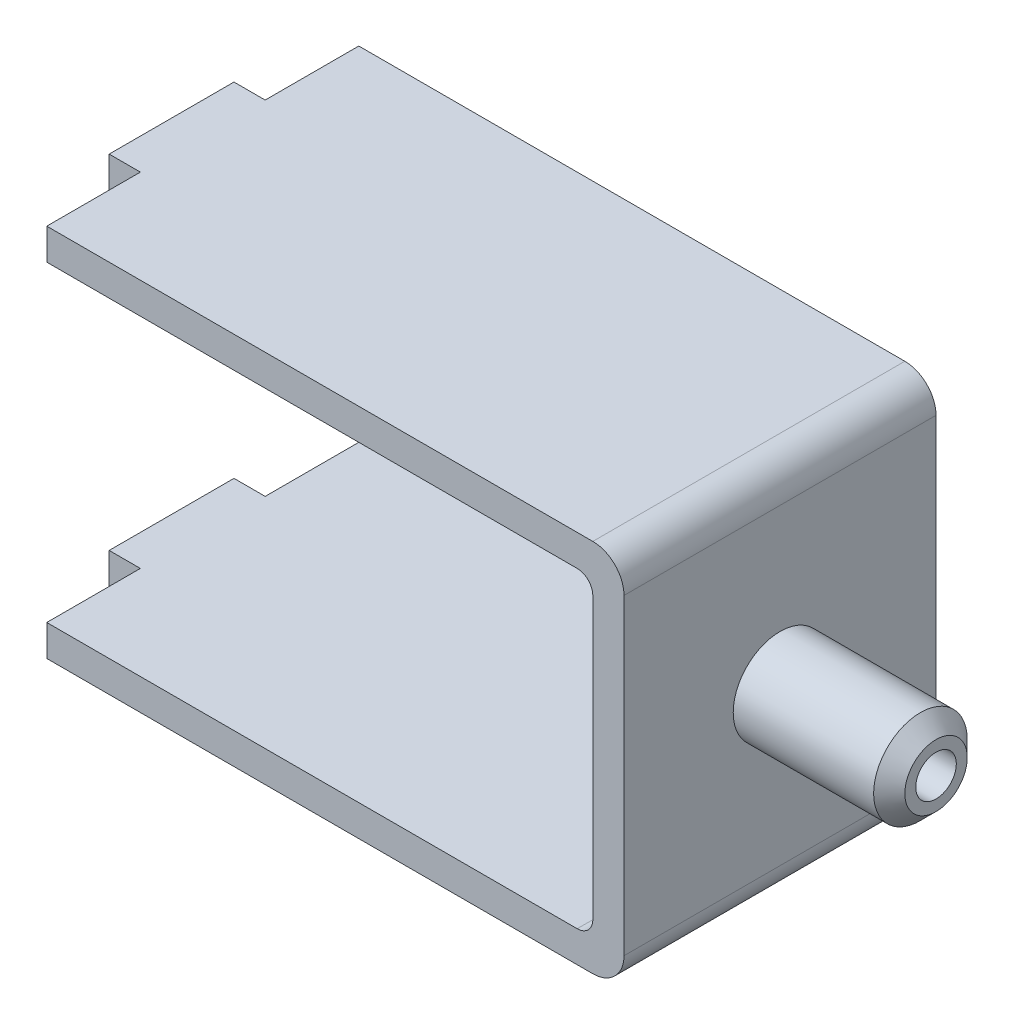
ISO-10303-21;
HEADER;
FILE_DESCRIPTION(('STEP AP214'),'2;1');
FILE_NAME('part.step','',(''),(''),'','','');
FILE_SCHEMA(('AUTOMOTIVE_DESIGN { 1 0 10303 214 1 1 1 1 }'));
ENDSEC;
DATA;
#1=APPLICATION_CONTEXT('core data for automotive mechanical design processes');
#2=APPLICATION_PROTOCOL_DEFINITION('international standard','automotive_design',2000,#1);
#3=PRODUCT_CONTEXT('',#1,'mechanical');
#4=PRODUCT('Part','Part','',(#3));
#5=PRODUCT_RELATED_PRODUCT_CATEGORY('part','',(#4));
#6=PRODUCT_DEFINITION_FORMATION('','',#4);
#7=PRODUCT_DEFINITION_CONTEXT('part definition',#1,'design');
#8=PRODUCT_DEFINITION('design','',#6,#7);
#9=PRODUCT_DEFINITION_SHAPE('','',#8);
#10=(LENGTH_UNIT() NAMED_UNIT(*) SI_UNIT(.MILLI.,.METRE.));
#11=(NAMED_UNIT(*) PLANE_ANGLE_UNIT() SI_UNIT($,.RADIAN.));
#12=(NAMED_UNIT(*) SI_UNIT($,.STERADIAN.) SOLID_ANGLE_UNIT());
#13=UNCERTAINTY_MEASURE_WITH_UNIT(LENGTH_MEASURE(1.E-05),#10,'distance_accuracy_value','');
#14=(GEOMETRIC_REPRESENTATION_CONTEXT(3) GLOBAL_UNCERTAINTY_ASSIGNED_CONTEXT((#13)) GLOBAL_UNIT_ASSIGNED_CONTEXT((#10,
#11,#12)) REPRESENTATION_CONTEXT('',''));
#15=CARTESIAN_POINT('',(0.,0.,0.));
#16=DIRECTION('',(0.,0.,1.));
#17=DIRECTION('',(1.,0.,0.));
#18=AXIS2_PLACEMENT_3D('',#15,#16,#17);
#19=CARTESIAN_POINT('',(0.,5.99999999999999,5.));
#20=DIRECTION('',(-1.,0.,0.));
#21=DIRECTION('',(0.,0.,1.));
#22=AXIS2_PLACEMENT_3D('',#19,#20,#21);
#23=PLANE('',#22);
#24=DIRECTION('',(0.,1.,0.));
#25=VECTOR('',#24,1.);
#26=CARTESIAN_POINT('',(0.,5.99999999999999,5.));
#27=LINE('',#26,#25);
#28=CARTESIAN_POINT('',(0.,-5.,5.));
#29=VERTEX_POINT('',#28);
#30=CARTESIAN_POINT('',(0.,4.99999999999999,5.));
#31=VERTEX_POINT('',#30);
#32=EDGE_CURVE('E202',#29,#31,#27,.T.);
#33=ORIENTED_EDGE('',*,*,#32,.F.);
#34=DIRECTION('',(0.,0.,-1.));
#35=VECTOR('',#34,1.);
#36=CARTESIAN_POINT('',(0.,-5.,5.));
#37=LINE('',#36,#35);
#38=CARTESIAN_POINT('',(0.,-5.,-5.));
#39=VERTEX_POINT('',#38);
#40=EDGE_CURVE('E212',#29,#39,#37,.T.);
#41=ORIENTED_EDGE('',*,*,#40,.T.);
#42=DIRECTION('',(0.,1.,0.));
#43=VECTOR('',#42,1.);
#44=CARTESIAN_POINT('',(0.,5.99999999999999,-5.));
#45=LINE('',#44,#43);
#46=CARTESIAN_POINT('',(0.,4.99999999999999,-5.));
#47=VERTEX_POINT('',#46);
#48=EDGE_CURVE('E357',#39,#47,#45,.T.);
#49=ORIENTED_EDGE('',*,*,#48,.T.);
#50=DIRECTION('',(0.,0.,-1.));
#51=VECTOR('',#50,1.);
#52=CARTESIAN_POINT('',(0.,4.99999999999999,5.));
#53=LINE('',#52,#51);
#54=EDGE_CURVE('E210',#47,#31,#53,.F.);
#55=ORIENTED_EDGE('',*,*,#54,.T.);
#56=EDGE_LOOP('',(#33,#41,#49,#55));
#57=FACE_BOUND('',#56,.T.);
#58=CARTESIAN_POINT('',(0.,0.,0.));
#59=DIRECTION('',(-1.,0.,0.));
#60=DIRECTION('',(0.,0.,1.));
#61=AXIS2_PLACEMENT_3D('',#58,#59,#60);
#62=CIRCLE('',#61,1.5);
#63=CARTESIAN_POINT('',(0.,0.,1.5));
#64=VERTEX_POINT('',#63);
#65=EDGE_CURVE('E255',#64,#64,#62,.F.);
#66=ORIENTED_EDGE('',*,*,#65,.F.);
#67=EDGE_LOOP('',(#66));
#68=FACE_BOUND('',#67,.T.);
#69=ADVANCED_FACE('F33',(#57,#68),#23,.F.);
#70=CARTESIAN_POINT('',(-19.5,5.99999999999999,5.));
#71=DIRECTION('',(1.,0.,0.));
#72=DIRECTION('',(0.,0.,-1.));
#73=AXIS2_PLACEMENT_3D('',#70,#71,#72);
#74=PLANE('',#73);
#75=DIRECTION('',(0.,0.,-1.));
#76=VECTOR('',#75,1.);
#77=CARTESIAN_POINT('',(-19.5,5.99999999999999,5.));
#78=LINE('',#77,#76);
#79=CARTESIAN_POINT('',(-19.5,5.99999999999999,2.));
#80=VERTEX_POINT('',#79);
#81=CARTESIAN_POINT('',(-19.5,5.99999999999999,-2.));
#82=VERTEX_POINT('',#81);
#83=EDGE_CURVE('E190',#80,#82,#78,.T.);
#84=ORIENTED_EDGE('',*,*,#83,.T.);
#85=DIRECTION('',(0.,1.,0.));
#86=VECTOR('',#85,1.);
#87=CARTESIAN_POINT('',(-19.5,-6.,-2.));
#88=LINE('',#87,#86);
#89=CARTESIAN_POINT('',(-19.5,4.99999999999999,-2.));
#90=VERTEX_POINT('',#89);
#91=EDGE_CURVE('E171',#90,#82,#88,.T.);
#92=ORIENTED_EDGE('',*,*,#91,.F.);
#93=DIRECTION('',(0.,0.,-1.));
#94=VECTOR('',#93,1.);
#95=CARTESIAN_POINT('',(-19.5,4.99999999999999,5.));
#96=LINE('',#95,#94);
#97=CARTESIAN_POINT('',(-19.5,4.99999999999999,2.));
#98=VERTEX_POINT('',#97);
#99=EDGE_CURVE('E208',#98,#90,#96,.T.);
#100=ORIENTED_EDGE('',*,*,#99,.F.);
#101=DIRECTION('',(0.,1.,0.));
#102=VECTOR('',#101,1.);
#103=CARTESIAN_POINT('',(-19.5,-6.,2.));
#104=LINE('',#103,#102);
#105=EDGE_CURVE('E194',#98,#80,#104,.T.);
#106=ORIENTED_EDGE('',*,*,#105,.T.);
#107=EDGE_LOOP('',(#84,#92,#100,#106));
#108=FACE_BOUND('',#107,.T.);
#109=ADVANCED_FACE('F35',(#108),#74,.F.);
#110=CARTESIAN_POINT('',(-18.5,4.99999999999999,5.));
#111=DIRECTION('',(0.,1.,0.));
#112=DIRECTION('',(0.,0.,1.));
#113=AXIS2_PLACEMENT_3D('',#110,#111,#112);
#114=PLANE('',#113);
#115=DIRECTION('',(1.,0.,0.));
#116=VECTOR('',#115,1.);
#117=CARTESIAN_POINT('',(-18.5,4.99999999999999,-2.));
#118=LINE('',#117,#116);
#119=CARTESIAN_POINT('',(-18.5,4.99999999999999,-2.));
#120=VERTEX_POINT('',#119);
#121=EDGE_CURVE('E177',#90,#120,#118,.T.);
#122=ORIENTED_EDGE('',*,*,#121,.T.);
#123=DIRECTION('',(0.,0.,-1.));
#124=VECTOR('',#123,1.);
#125=CARTESIAN_POINT('',(-18.5,4.99999999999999,5.));
#126=LINE('',#125,#124);
#127=CARTESIAN_POINT('',(-18.5,4.99999999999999,-5.));
#128=VERTEX_POINT('',#127);
#129=EDGE_CURVE('E307',#120,#128,#126,.T.);
#130=ORIENTED_EDGE('',*,*,#129,.T.);
#131=DIRECTION('',(1.,0.,0.));
#132=VECTOR('',#131,1.);
#133=CARTESIAN_POINT('',(-18.5,4.99999999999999,-5.));
#134=LINE('',#133,#132);
#135=CARTESIAN_POINT('',(-1.5,4.99999999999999,-5.));
#136=VERTEX_POINT('',#135);
#137=EDGE_CURVE('E347',#128,#136,#134,.T.);
#138=ORIENTED_EDGE('',*,*,#137,.T.);
#139=DIRECTION('',(0.,0.,-1.));
#140=VECTOR('',#139,1.);
#141=CARTESIAN_POINT('',(-1.5,4.99999999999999,5.));
#142=LINE('',#141,#140);
#143=CARTESIAN_POINT('',(-1.5,4.99999999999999,5.));
#144=VERTEX_POINT('',#143);
#145=EDGE_CURVE('E235',#136,#144,#142,.F.);
#146=ORIENTED_EDGE('',*,*,#145,.T.);
#147=DIRECTION('',(1.,0.,0.));
#148=VECTOR('',#147,1.);
#149=CARTESIAN_POINT('',(-18.5,4.99999999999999,5.));
#150=LINE('',#149,#148);
#151=CARTESIAN_POINT('',(-18.5,4.99999999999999,5.));
#152=VERTEX_POINT('',#151);
#153=EDGE_CURVE('E362',#152,#144,#150,.T.);
#154=ORIENTED_EDGE('',*,*,#153,.F.);
#155=DIRECTION('',(0.,0.,-1.));
#156=VECTOR('',#155,1.);
#157=CARTESIAN_POINT('',(-18.5,4.99999999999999,5.));
#158=LINE('',#157,#156);
#159=CARTESIAN_POINT('',(-18.5,4.99999999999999,2.));
#160=VERTEX_POINT('',#159);
#161=EDGE_CURVE('E339',#152,#160,#158,.T.);
#162=ORIENTED_EDGE('',*,*,#161,.T.);
#163=DIRECTION('',(-1.,0.,0.));
#164=VECTOR('',#163,1.);
#165=CARTESIAN_POINT('',(-18.5,4.99999999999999,2.));
#166=LINE('',#165,#164);
#167=EDGE_CURVE('E345',#160,#98,#166,.T.);
#168=ORIENTED_EDGE('',*,*,#167,.T.);
#169=ORIENTED_EDGE('',*,*,#99,.T.);
#170=EDGE_LOOP('',(#122,#130,#138,#146,#154,#162,#168,#169));
#171=FACE_BOUND('',#170,.T.);
#172=ADVANCED_FACE('F281',(#171),#114,.F.);
#173=CARTESIAN_POINT('',(-1.,4.99999999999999,5.));
#174=DIRECTION('',(1.,0.,0.));
#175=DIRECTION('',(0.,1.,0.));
#176=AXIS2_PLACEMENT_3D('',#173,#174,#175);
#177=PLANE('',#176);
#178=DIRECTION('',(0.,-1.,0.));
#179=VECTOR('',#178,1.);
#180=CARTESIAN_POINT('',(-1.,4.99999999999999,5.));
#181=LINE('',#180,#179);
#182=CARTESIAN_POINT('',(-1.,4.49999999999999,5.));
#183=VERTEX_POINT('',#182);
#184=CARTESIAN_POINT('',(-0.999999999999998,-4.5,5.));
#185=VERTEX_POINT('',#184);
#186=EDGE_CURVE('E364',#183,#185,#181,.T.);
#187=ORIENTED_EDGE('',*,*,#186,.F.);
#188=DIRECTION('',(0.,0.,-1.));
#189=VECTOR('',#188,1.);
#190=CARTESIAN_POINT('',(-1.,4.49999999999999,-5.));
#191=LINE('',#190,#189);
#192=CARTESIAN_POINT('',(-1.,4.49999999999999,-5.));
#193=VERTEX_POINT('',#192);
#194=EDGE_CURVE('E232',#183,#193,#191,.T.);
#195=ORIENTED_EDGE('',*,*,#194,.T.);
#196=DIRECTION('',(0.,-1.,0.));
#197=VECTOR('',#196,1.);
#198=CARTESIAN_POINT('',(-1.,4.99999999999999,-5.));
#199=LINE('',#198,#197);
#200=CARTESIAN_POINT('',(-0.999999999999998,-4.5,-5.));
#201=VERTEX_POINT('',#200);
#202=EDGE_CURVE('E349',#193,#201,#199,.T.);
#203=ORIENTED_EDGE('',*,*,#202,.T.);
#204=DIRECTION('',(0.,0.,-1.));
#205=VECTOR('',#204,1.);
#206=CARTESIAN_POINT('',(-0.999999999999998,-4.5,5.));
#207=LINE('',#206,#205);
#208=EDGE_CURVE('E230',#201,#185,#207,.F.);
#209=ORIENTED_EDGE('',*,*,#208,.T.);
#210=EDGE_LOOP('',(#187,#195,#203,#209));
#211=FACE_BOUND('',#210,.T.);
#212=ADVANCED_FACE('F298',(#211),#177,.F.);
#213=CARTESIAN_POINT('',(-18.5,-5.,5.));
#214=DIRECTION('',(0.,-1.,0.));
#215=DIRECTION('',(0.,0.,-1.));
#216=AXIS2_PLACEMENT_3D('',#213,#214,#215);
#217=PLANE('',#216);
#218=DIRECTION('',(-1.,0.,0.));
#219=VECTOR('',#218,1.);
#220=CARTESIAN_POINT('',(-18.5,-5.,-5.));
#221=LINE('',#220,#219);
#222=CARTESIAN_POINT('',(-1.5,-5.,-5.));
#223=VERTEX_POINT('',#222);
#224=CARTESIAN_POINT('',(-18.5,-5.,-5.));
#225=VERTEX_POINT('',#224);
#226=EDGE_CURVE('E352',#223,#225,#221,.T.);
#227=ORIENTED_EDGE('',*,*,#226,.T.);
#228=DIRECTION('',(0.,0.,1.));
#229=VECTOR('',#228,1.);
#230=CARTESIAN_POINT('',(-18.5,-5.,5.));
#231=LINE('',#230,#229);
#232=CARTESIAN_POINT('',(-18.5,-5.,-2.));
#233=VERTEX_POINT('',#232);
#234=EDGE_CURVE('E56',#225,#233,#231,.T.);
#235=ORIENTED_EDGE('',*,*,#234,.T.);
#236=DIRECTION('',(-1.,0.,0.));
#237=VECTOR('',#236,1.);
#238=CARTESIAN_POINT('',(-18.5,-5.,-2.));
#239=LINE('',#238,#237);
#240=CARTESIAN_POINT('',(-19.5,-5.,-2.));
#241=VERTEX_POINT('',#240);
#242=EDGE_CURVE('E311',#233,#241,#239,.T.);
#243=ORIENTED_EDGE('',*,*,#242,.T.);
#244=DIRECTION('',(0.,0.,-1.));
#245=VECTOR('',#244,1.);
#246=CARTESIAN_POINT('',(-19.5,-5.,5.));
#247=LINE('',#246,#245);
#248=CARTESIAN_POINT('',(-19.5,-5.,2.));
#249=VERTEX_POINT('',#248);
#250=EDGE_CURVE('E199',#249,#241,#247,.T.);
#251=ORIENTED_EDGE('',*,*,#250,.F.);
#252=DIRECTION('',(1.,0.,0.));
#253=VECTOR('',#252,1.);
#254=CARTESIAN_POINT('',(-18.5,-5.,2.));
#255=LINE('',#254,#253);
#256=CARTESIAN_POINT('',(-18.5,-5.,2.));
#257=VERTEX_POINT('',#256);
#258=EDGE_CURVE('E342',#249,#257,#255,.T.);
#259=ORIENTED_EDGE('',*,*,#258,.T.);
#260=DIRECTION('',(0.,0.,1.));
#261=VECTOR('',#260,1.);
#262=CARTESIAN_POINT('',(-18.5,-5.,5.));
#263=LINE('',#262,#261);
#264=CARTESIAN_POINT('',(-18.5,-5.,5.));
#265=VERTEX_POINT('',#264);
#266=EDGE_CURVE('E331',#257,#265,#263,.T.);
#267=ORIENTED_EDGE('',*,*,#266,.T.);
#268=DIRECTION('',(-1.,0.,0.));
#269=VECTOR('',#268,1.);
#270=CARTESIAN_POINT('',(-18.5,-5.,5.));
#271=LINE('',#270,#269);
#272=CARTESIAN_POINT('',(-1.5,-5.,5.));
#273=VERTEX_POINT('',#272);
#274=EDGE_CURVE('E367',#273,#265,#271,.T.);
#275=ORIENTED_EDGE('',*,*,#274,.F.);
#276=DIRECTION('',(0.,0.,-1.));
#277=VECTOR('',#276,1.);
#278=CARTESIAN_POINT('',(-1.5,-5.,-5.));
#279=LINE('',#278,#277);
#280=EDGE_CURVE('E238',#273,#223,#279,.T.);
#281=ORIENTED_EDGE('',*,*,#280,.T.);
#282=EDGE_LOOP('',(#227,#235,#243,#251,#259,#267,#275,#281));
#283=FACE_BOUND('',#282,.T.);
#284=ADVANCED_FACE('F294',(#283),#217,.F.);
#285=CARTESIAN_POINT('',(-19.5,-5.,5.));
#286=DIRECTION('',(1.,0.,0.));
#287=DIRECTION('',(0.,0.,-1.));
#288=AXIS2_PLACEMENT_3D('',#285,#286,#287);
#289=PLANE('',#288);
#290=ORIENTED_EDGE('',*,*,#250,.T.);
#291=CARTESIAN_POINT('',(-19.5,-6.,-2.));
#292=VERTEX_POINT('',#291);
#293=EDGE_CURVE('E182',#292,#241,#88,.T.);
#294=ORIENTED_EDGE('',*,*,#293,.F.);
#295=DIRECTION('',(0.,0.,-1.));
#296=VECTOR('',#295,1.);
#297=CARTESIAN_POINT('',(-19.5,-6.,5.));
#298=LINE('',#297,#296);
#299=CARTESIAN_POINT('',(-19.5,-6.,2.));
#300=VERTEX_POINT('',#299);
#301=EDGE_CURVE('E195',#300,#292,#298,.T.);
#302=ORIENTED_EDGE('',*,*,#301,.F.);
#303=EDGE_CURVE('E328',#300,#249,#104,.T.);
#304=ORIENTED_EDGE('',*,*,#303,.T.);
#305=EDGE_LOOP('',(#290,#294,#302,#304));
#306=FACE_BOUND('',#305,.T.);
#307=ADVANCED_FACE('F290',(#306),#289,.F.);
#308=CARTESIAN_POINT('',(-19.5,-6.,5.));
#309=DIRECTION('',(0.,1.,0.));
#310=DIRECTION('',(-1.,0.,0.));
#311=AXIS2_PLACEMENT_3D('',#308,#309,#310);
#312=PLANE('',#311);
#313=DIRECTION('',(1.,0.,0.));
#314=VECTOR('',#313,1.);
#315=CARTESIAN_POINT('',(-19.5,-6.,-2.));
#316=LINE('',#315,#314);
#317=CARTESIAN_POINT('',(-18.5,-6.,-2.));
#318=VERTEX_POINT('',#317);
#319=EDGE_CURVE('E631',#292,#318,#316,.T.);
#320=ORIENTED_EDGE('',*,*,#319,.T.);
#321=DIRECTION('',(0.,0.,-1.));
#322=VECTOR('',#321,1.);
#323=CARTESIAN_POINT('',(-18.5,-6.,-2.));
#324=LINE('',#323,#322);
#325=CARTESIAN_POINT('',(-18.5,-6.,-5.));
#326=VERTEX_POINT('',#325);
#327=EDGE_CURVE('E183',#318,#326,#324,.T.);
#328=ORIENTED_EDGE('',*,*,#327,.T.);
#329=DIRECTION('',(1.,0.,0.));
#330=VECTOR('',#329,1.);
#331=CARTESIAN_POINT('',(-19.5,-6.,-5.));
#332=LINE('',#331,#330);
#333=CARTESIAN_POINT('',(-1.,-6.,-5.));
#334=VERTEX_POINT('',#333);
#335=EDGE_CURVE('E355',#326,#334,#332,.T.);
#336=ORIENTED_EDGE('',*,*,#335,.T.);
#337=DIRECTION('',(0.,0.,-1.));
#338=VECTOR('',#337,1.);
#339=CARTESIAN_POINT('',(-1.,-6.,5.));
#340=LINE('',#339,#338);
#341=CARTESIAN_POINT('',(-1.,-6.,5.));
#342=VERTEX_POINT('',#341);
#343=EDGE_CURVE('E220',#334,#342,#340,.F.);
#344=ORIENTED_EDGE('',*,*,#343,.T.);
#345=DIRECTION('',(1.,0.,0.));
#346=VECTOR('',#345,1.);
#347=CARTESIAN_POINT('',(-19.5,-6.,5.));
#348=LINE('',#347,#346);
#349=CARTESIAN_POINT('',(-18.5,-6.,5.));
#350=VERTEX_POINT('',#349);
#351=EDGE_CURVE('E370',#350,#342,#348,.T.);
#352=ORIENTED_EDGE('',*,*,#351,.F.);
#353=DIRECTION('',(0.,0.,-1.));
#354=VECTOR('',#353,1.);
#355=CARTESIAN_POINT('',(-18.5,-6.,2.));
#356=LINE('',#355,#354);
#357=CARTESIAN_POINT('',(-18.5,-6.,2.));
#358=VERTEX_POINT('',#357);
#359=EDGE_CURVE('E321',#350,#358,#356,.T.);
#360=ORIENTED_EDGE('',*,*,#359,.T.);
#361=DIRECTION('',(-1.,0.,0.));
#362=VECTOR('',#361,1.);
#363=CARTESIAN_POINT('',(-19.5,-6.,2.));
#364=LINE('',#363,#362);
#365=EDGE_CURVE('E324',#358,#300,#364,.T.);
#366=ORIENTED_EDGE('',*,*,#365,.T.);
#367=ORIENTED_EDGE('',*,*,#301,.T.);
#368=EDGE_LOOP('',(#320,#328,#336,#344,#352,#360,#366,#367));
#369=FACE_BOUND('',#368,.T.);
#370=ADVANCED_FACE('F287',(#369),#312,.F.);
#371=CARTESIAN_POINT('',(-19.5,5.99999999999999,5.));
#372=DIRECTION('',(0.,-1.,0.));
#373=DIRECTION('',(0.,0.,-1.));
#374=AXIS2_PLACEMENT_3D('',#371,#372,#373);
#375=PLANE('',#374);
#376=DIRECTION('',(-1.,0.,0.));
#377=VECTOR('',#376,1.);
#378=CARTESIAN_POINT('',(-19.5,5.99999999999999,-5.));
#379=LINE('',#378,#377);
#380=CARTESIAN_POINT('',(-1.,5.99999999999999,-5.));
#381=VERTEX_POINT('',#380);
#382=CARTESIAN_POINT('',(-18.5,5.99999999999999,-5.));
#383=VERTEX_POINT('',#382);
#384=EDGE_CURVE('E360',#381,#383,#379,.T.);
#385=ORIENTED_EDGE('',*,*,#384,.T.);
#386=DIRECTION('',(0.,0.,-1.));
#387=VECTOR('',#386,1.);
#388=CARTESIAN_POINT('',(-18.5,5.99999999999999,-2.));
#389=LINE('',#388,#387);
#390=CARTESIAN_POINT('',(-18.5,5.99999999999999,-2.));
#391=VERTEX_POINT('',#390);
#392=EDGE_CURVE('E48',#391,#383,#389,.T.);
#393=ORIENTED_EDGE('',*,*,#392,.F.);
#394=DIRECTION('',(1.,0.,0.));
#395=VECTOR('',#394,1.);
#396=CARTESIAN_POINT('',(-19.5,5.99999999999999,-2.));
#397=LINE('',#396,#395);
#398=EDGE_CURVE('E175',#82,#391,#397,.T.);
#399=ORIENTED_EDGE('',*,*,#398,.F.);
#400=ORIENTED_EDGE('',*,*,#83,.F.);
#401=DIRECTION('',(-1.,0.,0.));
#402=VECTOR('',#401,1.);
#403=CARTESIAN_POINT('',(-19.5,5.99999999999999,2.));
#404=LINE('',#403,#402);
#405=CARTESIAN_POINT('',(-18.5,5.99999999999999,2.));
#406=VERTEX_POINT('',#405);
#407=EDGE_CURVE('E314',#406,#80,#404,.T.);
#408=ORIENTED_EDGE('',*,*,#407,.F.);
#409=DIRECTION('',(0.,0.,-1.));
#410=VECTOR('',#409,1.);
#411=CARTESIAN_POINT('',(-18.5,5.99999999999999,2.));
#412=LINE('',#411,#410);
#413=CARTESIAN_POINT('',(-18.5,5.99999999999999,5.));
#414=VERTEX_POINT('',#413);
#415=EDGE_CURVE('E310',#414,#406,#412,.T.);
#416=ORIENTED_EDGE('',*,*,#415,.F.);
#417=DIRECTION('',(-1.,0.,0.));
#418=VECTOR('',#417,1.);
#419=CARTESIAN_POINT('',(-19.5,5.99999999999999,5.));
#420=LINE('',#419,#418);
#421=CARTESIAN_POINT('',(-1.,5.99999999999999,5.));
#422=VERTEX_POINT('',#421);
#423=EDGE_CURVE('E196',#422,#414,#420,.T.);
#424=ORIENTED_EDGE('',*,*,#423,.F.);
#425=DIRECTION('',(0.,0.,-1.));
#426=VECTOR('',#425,1.);
#427=CARTESIAN_POINT('',(-1.,5.99999999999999,5.));
#428=LINE('',#427,#426);
#429=EDGE_CURVE('E227',#422,#381,#428,.T.);
#430=ORIENTED_EDGE('',*,*,#429,.T.);
#431=EDGE_LOOP('',(#385,#393,#399,#400,#408,#416,#424,#430));
#432=FACE_BOUND('',#431,.T.);
#433=ADVANCED_FACE('F188',(#432),#375,.F.);
#434=CARTESIAN_POINT('',(-19.5,4.99999999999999,5.));
#435=DIRECTION('',(0.,0.,-1.));
#436=DIRECTION('',(-1.,0.,0.));
#437=AXIS2_PLACEMENT_3D('',#434,#435,#436);
#438=PLANE('',#437);
#439=ORIENTED_EDGE('',*,*,#423,.T.);
#440=DIRECTION('',(0.,-1.,0.));
#441=VECTOR('',#440,1.);
#442=CARTESIAN_POINT('',(-18.5,4.99999999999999,5.));
#443=LINE('',#442,#441);
#444=EDGE_CURVE('E250',#414,#152,#443,.T.);
#445=ORIENTED_EDGE('',*,*,#444,.T.);
#446=ORIENTED_EDGE('',*,*,#153,.T.);
#447=CARTESIAN_POINT('',(-1.5,4.49999999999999,5.));
#448=DIRECTION('',(0.,0.,-1.));
#449=DIRECTION('',(-1.,0.,0.));
#450=AXIS2_PLACEMENT_3D('',#447,#448,#449);
#451=CIRCLE('',#450,0.5);
#452=EDGE_CURVE('E244',#144,#183,#451,.T.);
#453=ORIENTED_EDGE('',*,*,#452,.T.);
#454=ORIENTED_EDGE('',*,*,#186,.T.);
#455=CARTESIAN_POINT('',(-1.5,-4.5,5.));
#456=DIRECTION('',(0.,0.,-1.));
#457=DIRECTION('',(-1.,0.,0.));
#458=AXIS2_PLACEMENT_3D('',#455,#456,#457);
#459=CIRCLE('',#458,0.5);
#460=EDGE_CURVE('E248',#185,#273,#459,.T.);
#461=ORIENTED_EDGE('',*,*,#460,.T.);
#462=ORIENTED_EDGE('',*,*,#274,.T.);
#463=DIRECTION('',(0.,1.,0.));
#464=VECTOR('',#463,1.);
#465=CARTESIAN_POINT('',(-18.5,-6.,5.));
#466=LINE('',#465,#464);
#467=EDGE_CURVE('E327',#350,#265,#466,.T.);
#468=ORIENTED_EDGE('',*,*,#467,.F.);
#469=ORIENTED_EDGE('',*,*,#351,.T.);
#470=CARTESIAN_POINT('',(-1.,-5.,5.));
#471=DIRECTION('',(0.,0.,-1.));
#472=DIRECTION('',(-1.,0.,0.));
#473=AXIS2_PLACEMENT_3D('',#470,#471,#472);
#474=CIRCLE('',#473,1.);
#475=EDGE_CURVE('E225',#342,#29,#474,.F.);
#476=ORIENTED_EDGE('',*,*,#475,.T.);
#477=ORIENTED_EDGE('',*,*,#32,.T.);
#478=CARTESIAN_POINT('',(-1.,4.99999999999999,5.));
#479=DIRECTION('',(0.,0.,-1.));
#480=DIRECTION('',(-1.,0.,0.));
#481=AXIS2_PLACEMENT_3D('',#478,#479,#480);
#482=CIRCLE('',#481,1.);
#483=EDGE_CURVE('E223',#31,#422,#482,.F.);
#484=ORIENTED_EDGE('',*,*,#483,.T.);
#485=EDGE_LOOP('',(#439,#445,#446,#453,#454,#461,#462,#468,#469,#476,#477,#484));
#486=FACE_BOUND('',#485,.T.);
#487=ADVANCED_FACE('F374',(#486),#438,.F.);
#488=CARTESIAN_POINT('',(-19.5,4.99999999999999,-5.));
#489=DIRECTION('',(0.,0.,-1.));
#490=DIRECTION('',(-1.,0.,0.));
#491=AXIS2_PLACEMENT_3D('',#488,#489,#490);
#492=PLANE('',#491);
#493=DIRECTION('',(0.,-1.,0.));
#494=VECTOR('',#493,1.);
#495=CARTESIAN_POINT('',(-18.5,4.99999999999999,-5.));
#496=LINE('',#495,#494);
#497=EDGE_CURVE('E253',#383,#128,#496,.T.);
#498=ORIENTED_EDGE('',*,*,#497,.F.);
#499=ORIENTED_EDGE('',*,*,#384,.F.);
#500=CARTESIAN_POINT('',(-1.,4.99999999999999,-5.));
#501=DIRECTION('',(0.,0.,-1.));
#502=DIRECTION('',(-1.,0.,0.));
#503=AXIS2_PLACEMENT_3D('',#500,#501,#502);
#504=CIRCLE('',#503,1.);
#505=EDGE_CURVE('E215',#381,#47,#504,.T.);
#506=ORIENTED_EDGE('',*,*,#505,.T.);
#507=ORIENTED_EDGE('',*,*,#48,.F.);
#508=CARTESIAN_POINT('',(-1.,-5.,-5.));
#509=DIRECTION('',(0.,0.,-1.));
#510=DIRECTION('',(-1.,0.,0.));
#511=AXIS2_PLACEMENT_3D('',#508,#509,#510);
#512=CIRCLE('',#511,1.);
#513=EDGE_CURVE('E217',#39,#334,#512,.T.);
#514=ORIENTED_EDGE('',*,*,#513,.T.);
#515=ORIENTED_EDGE('',*,*,#335,.F.);
#516=DIRECTION('',(0.,1.,0.));
#517=VECTOR('',#516,1.);
#518=CARTESIAN_POINT('',(-18.5,-6.,-5.));
#519=LINE('',#518,#517);
#520=EDGE_CURVE('E391',#326,#225,#519,.T.);
#521=ORIENTED_EDGE('',*,*,#520,.T.);
#522=ORIENTED_EDGE('',*,*,#226,.F.);
#523=CARTESIAN_POINT('',(-1.5,-4.5,-5.));
#524=DIRECTION('',(0.,0.,-1.));
#525=DIRECTION('',(-1.,0.,0.));
#526=AXIS2_PLACEMENT_3D('',#523,#524,#525);
#527=CIRCLE('',#526,0.5);
#528=EDGE_CURVE('E246',#223,#201,#527,.F.);
#529=ORIENTED_EDGE('',*,*,#528,.T.);
#530=ORIENTED_EDGE('',*,*,#202,.F.);
#531=CARTESIAN_POINT('',(-1.5,4.49999999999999,-5.));
#532=DIRECTION('',(0.,0.,-1.));
#533=DIRECTION('',(-1.,0.,0.));
#534=AXIS2_PLACEMENT_3D('',#531,#532,#533);
#535=CIRCLE('',#534,0.5);
#536=EDGE_CURVE('E241',#193,#136,#535,.F.);
#537=ORIENTED_EDGE('',*,*,#536,.T.);
#538=ORIENTED_EDGE('',*,*,#137,.F.);
#539=EDGE_LOOP('',(#498,#499,#506,#507,#514,#515,#521,#522,#529,#530,#537,#538));
#540=FACE_BOUND('',#539,.T.);
#541=ADVANCED_FACE('F385',(#540),#492,.T.);
#542=CARTESIAN_POINT('',(-1.,-5.,5.));
#543=DIRECTION('',(0.,0.,-1.));
#544=DIRECTION('',(-1.,0.,0.));
#545=AXIS2_PLACEMENT_3D('',#542,#543,#544);
#546=CYLINDRICAL_SURFACE('',#545,1.);
#547=ORIENTED_EDGE('',*,*,#475,.F.);
#548=ORIENTED_EDGE('',*,*,#343,.F.);
#549=ORIENTED_EDGE('',*,*,#513,.F.);
#550=ORIENTED_EDGE('',*,*,#40,.F.);
#551=EDGE_LOOP('',(#547,#548,#549,#550));
#552=FACE_BOUND('',#551,.T.);
#553=ADVANCED_FACE('F438',(#552),#546,.T.);
#554=CARTESIAN_POINT('',(-1.,4.99999999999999,5.));
#555=DIRECTION('',(0.,0.,-1.));
#556=DIRECTION('',(-1.,0.,0.));
#557=AXIS2_PLACEMENT_3D('',#554,#555,#556);
#558=CYLINDRICAL_SURFACE('',#557,1.);
#559=ORIENTED_EDGE('',*,*,#483,.F.);
#560=ORIENTED_EDGE('',*,*,#54,.F.);
#561=ORIENTED_EDGE('',*,*,#505,.F.);
#562=ORIENTED_EDGE('',*,*,#429,.F.);
#563=EDGE_LOOP('',(#559,#560,#561,#562));
#564=FACE_BOUND('',#563,.T.);
#565=ADVANCED_FACE('F381',(#564),#558,.T.);
#566=CARTESIAN_POINT('',(-1.5,4.49999999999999,5.));
#567=DIRECTION('',(0.,0.,1.));
#568=DIRECTION('',(1.,0.,0.));
#569=AXIS2_PLACEMENT_3D('',#566,#567,#568);
#570=CYLINDRICAL_SURFACE('',#569,0.5);
#571=ORIENTED_EDGE('',*,*,#452,.F.);
#572=ORIENTED_EDGE('',*,*,#145,.F.);
#573=ORIENTED_EDGE('',*,*,#536,.F.);
#574=ORIENTED_EDGE('',*,*,#194,.F.);
#575=EDGE_LOOP('',(#571,#572,#573,#574));
#576=FACE_BOUND('',#575,.T.);
#577=ADVANCED_FACE('F410',(#576),#570,.F.);
#578=CARTESIAN_POINT('',(-1.5,-4.5,5.));
#579=DIRECTION('',(0.,0.,1.));
#580=DIRECTION('',(1.,0.,0.));
#581=AXIS2_PLACEMENT_3D('',#578,#579,#580);
#582=CYLINDRICAL_SURFACE('',#581,0.5);
#583=ORIENTED_EDGE('',*,*,#460,.F.);
#584=ORIENTED_EDGE('',*,*,#208,.F.);
#585=ORIENTED_EDGE('',*,*,#528,.F.);
#586=ORIENTED_EDGE('',*,*,#280,.F.);
#587=EDGE_LOOP('',(#583,#584,#585,#586));
#588=FACE_BOUND('',#587,.T.);
#589=ADVANCED_FACE('F403',(#588),#582,.F.);
#590=CARTESIAN_POINT('',(-18.5,-6.,2.));
#591=DIRECTION('',(1.,0.,0.));
#592=DIRECTION('',(0.,0.,-1.));
#593=AXIS2_PLACEMENT_3D('',#590,#591,#592);
#594=PLANE('',#593);
#595=DIRECTION('',(0.,1.,0.));
#596=VECTOR('',#595,1.);
#597=CARTESIAN_POINT('',(-18.5,-6.,2.));
#598=LINE('',#597,#596);
#599=EDGE_CURVE('E332',#358,#257,#598,.T.);
#600=ORIENTED_EDGE('',*,*,#599,.F.);
#601=ORIENTED_EDGE('',*,*,#359,.F.);
#602=ORIENTED_EDGE('',*,*,#467,.T.);
#603=ORIENTED_EDGE('',*,*,#266,.F.);
#604=EDGE_LOOP('',(#600,#601,#602,#603));
#605=FACE_BOUND('',#604,.T.);
#606=ADVANCED_FACE('F427',(#605),#594,.F.);
#607=CARTESIAN_POINT('',(-19.5,-6.,2.));
#608=DIRECTION('',(0.,0.,-1.));
#609=DIRECTION('',(-1.,0.,0.));
#610=AXIS2_PLACEMENT_3D('',#607,#608,#609);
#611=PLANE('',#610);
#612=ORIENTED_EDGE('',*,*,#303,.F.);
#613=ORIENTED_EDGE('',*,*,#365,.F.);
#614=ORIENTED_EDGE('',*,*,#599,.T.);
#615=ORIENTED_EDGE('',*,*,#258,.F.);
#616=EDGE_LOOP('',(#612,#613,#614,#615));
#617=FACE_BOUND('',#616,.T.);
#618=ADVANCED_FACE('F419',(#617),#611,.F.);
#619=EDGE_CURVE('E335',#160,#406,#598,.T.);
#620=ORIENTED_EDGE('',*,*,#619,.T.);
#621=ORIENTED_EDGE('',*,*,#407,.T.);
#622=ORIENTED_EDGE('',*,*,#105,.F.);
#623=ORIENTED_EDGE('',*,*,#167,.F.);
#624=EDGE_LOOP('',(#620,#621,#622,#623));
#625=FACE_BOUND('',#624,.T.);
#626=ADVANCED_FACE('F417',(#625),#611,.F.);
#627=ORIENTED_EDGE('',*,*,#444,.F.);
#628=ORIENTED_EDGE('',*,*,#415,.T.);
#629=ORIENTED_EDGE('',*,*,#619,.F.);
#630=ORIENTED_EDGE('',*,*,#161,.F.);
#631=EDGE_LOOP('',(#627,#628,#629,#630));
#632=FACE_BOUND('',#631,.T.);
#633=ADVANCED_FACE('F414',(#632),#594,.F.);
#634=CARTESIAN_POINT('',(-18.5,-6.,-2.));
#635=DIRECTION('',(1.,0.,0.));
#636=DIRECTION('',(0.,0.,-1.));
#637=AXIS2_PLACEMENT_3D('',#634,#635,#636);
#638=PLANE('',#637);
#639=ORIENTED_EDGE('',*,*,#520,.F.);
#640=ORIENTED_EDGE('',*,*,#327,.F.);
#641=DIRECTION('',(0.,1.,0.));
#642=VECTOR('',#641,1.);
#643=CARTESIAN_POINT('',(-18.5,-6.,-2.));
#644=LINE('',#643,#642);
#645=EDGE_CURVE('E389',#318,#233,#644,.T.);
#646=ORIENTED_EDGE('',*,*,#645,.T.);
#647=ORIENTED_EDGE('',*,*,#234,.F.);
#648=EDGE_LOOP('',(#639,#640,#646,#647));
#649=FACE_BOUND('',#648,.T.);
#650=ADVANCED_FACE('F425',(#649),#638,.F.);
#651=CARTESIAN_POINT('',(-19.5,-6.,-2.));
#652=DIRECTION('',(0.,0.,1.));
#653=DIRECTION('',(1.,0.,0.));
#654=AXIS2_PLACEMENT_3D('',#651,#652,#653);
#655=PLANE('',#654);
#656=ORIENTED_EDGE('',*,*,#645,.F.);
#657=ORIENTED_EDGE('',*,*,#319,.F.);
#658=ORIENTED_EDGE('',*,*,#293,.T.);
#659=ORIENTED_EDGE('',*,*,#242,.F.);
#660=EDGE_LOOP('',(#656,#657,#658,#659));
#661=FACE_BOUND('',#660,.T.);
#662=ADVANCED_FACE('F527',(#661),#655,.F.);
#663=ORIENTED_EDGE('',*,*,#91,.T.);
#664=ORIENTED_EDGE('',*,*,#398,.T.);
#665=EDGE_CURVE('E388',#120,#391,#644,.T.);
#666=ORIENTED_EDGE('',*,*,#665,.F.);
#667=ORIENTED_EDGE('',*,*,#121,.F.);
#668=EDGE_LOOP('',(#663,#664,#666,#667));
#669=FACE_BOUND('',#668,.T.);
#670=ADVANCED_FACE('F173',(#669),#655,.F.);
#671=ORIENTED_EDGE('',*,*,#665,.T.);
#672=ORIENTED_EDGE('',*,*,#392,.T.);
#673=ORIENTED_EDGE('',*,*,#497,.T.);
#674=ORIENTED_EDGE('',*,*,#129,.F.);
#675=EDGE_LOOP('',(#671,#672,#673,#674));
#676=FACE_BOUND('',#675,.T.);
#677=ADVANCED_FACE('F387',(#676),#638,.F.);
#678=CARTESIAN_POINT('',(5.,0.,0.));
#679=DIRECTION('',(1.,0.,0.));
#680=DIRECTION('',(0.,0.,-1.));
#681=AXIS2_PLACEMENT_3D('',#678,#679,#680);
#682=PLANE('',#681);
#683=CARTESIAN_POINT('',(5.,0.,0.));
#684=DIRECTION('',(1.,0.,0.));
#685=DIRECTION('',(0.,0.,-1.));
#686=AXIS2_PLACEMENT_3D('',#683,#684,#685);
#687=CIRCLE('',#686,1.);
#688=CARTESIAN_POINT('',(5.,0.,-1.));
#689=VERTEX_POINT('',#688);
#690=EDGE_CURVE('E41',#689,#689,#687,.T.);
#691=ORIENTED_EDGE('',*,*,#690,.T.);
#692=EDGE_LOOP('',(#691));
#693=FACE_BOUND('',#692,.T.);
#694=CARTESIAN_POINT('',(5.,0.,0.));
#695=DIRECTION('',(1.,0.,0.));
#696=DIRECTION('',(0.,0.,-1.));
#697=AXIS2_PLACEMENT_3D('',#694,#695,#696);
#698=CIRCLE('',#697,0.65);
#699=CARTESIAN_POINT('',(5.,0.,-0.65));
#700=VERTEX_POINT('',#699);
#701=EDGE_CURVE('E191',#700,#700,#698,.T.);
#702=ORIENTED_EDGE('',*,*,#701,.F.);
#703=EDGE_LOOP('',(#702));
#704=FACE_BOUND('',#703,.T.);
#705=ADVANCED_FACE('F260',(#693,#704),#682,.T.);
#706=CARTESIAN_POINT('',(5.,0.,0.));
#707=DIRECTION('',(-1.,0.,0.));
#708=DIRECTION('',(0.,0.,1.));
#709=AXIS2_PLACEMENT_3D('',#706,#707,#708);
#710=CYLINDRICAL_SURFACE('',#709,1.5);
#711=CARTESIAN_POINT('',(4.5,0.,0.));
#712=DIRECTION('',(1.,0.,0.));
#713=DIRECTION('',(0.,0.,-1.));
#714=AXIS2_PLACEMENT_3D('',#711,#712,#713);
#715=CIRCLE('',#714,1.5);
#716=CARTESIAN_POINT('',(4.5,0.,-1.5));
#717=VERTEX_POINT('',#716);
#718=EDGE_CURVE('E11',#717,#717,#715,.F.);
#719=ORIENTED_EDGE('',*,*,#718,.T.);
#720=EDGE_LOOP('',(#719));
#721=FACE_BOUND('',#720,.T.);
#722=ORIENTED_EDGE('',*,*,#65,.T.);
#723=EDGE_LOOP('',(#722));
#724=FACE_BOUND('',#723,.T.);
#725=ADVANCED_FACE('F563',(#721,#724),#710,.T.);
#726=CARTESIAN_POINT('',(5.,0.,0.));
#727=DIRECTION('',(-1.,0.,0.));
#728=DIRECTION('',(0.,0.,1.));
#729=AXIS2_PLACEMENT_3D('',#726,#727,#728);
#730=CYLINDRICAL_SURFACE('',#729,0.65);
#731=ORIENTED_EDGE('',*,*,#701,.T.);
#732=EDGE_LOOP('',(#731));
#733=FACE_BOUND('',#732,.T.);
#734=CARTESIAN_POINT('',(0.,0.,0.));
#735=DIRECTION('',(1.,0.,0.));
#736=DIRECTION('',(0.,0.,-1.));
#737=AXIS2_PLACEMENT_3D('',#734,#735,#736);
#738=CIRCLE('',#737,0.65);
#739=CARTESIAN_POINT('',(0.,0.,-0.65));
#740=VERTEX_POINT('',#739);
#741=EDGE_CURVE('E626',#740,#740,#738,.T.);
#742=ORIENTED_EDGE('',*,*,#741,.F.);
#743=EDGE_LOOP('',(#742));
#744=FACE_BOUND('',#743,.T.);
#745=ADVANCED_FACE('F271',(#733,#744),#730,.F.);
#746=ORIENTED_EDGE('',*,*,#741,.T.);
#747=EDGE_LOOP('',(#746));
#748=FACE_BOUND('',#747,.T.);
#749=ADVANCED_FACE('F265',(#748),#23,.F.);
#750=CARTESIAN_POINT('',(5.,0.,0.));
#751=DIRECTION('',(-1.,0.,0.));
#752=DIRECTION('',(0.,0.,1.));
#753=AXIS2_PLACEMENT_3D('',#750,#751,#752);
#754=CONICAL_SURFACE('',#753,1.,0.785398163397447);
#755=ORIENTED_EDGE('',*,*,#718,.F.);
#756=EDGE_LOOP('',(#755));
#757=FACE_BOUND('',#756,.T.);
#758=ORIENTED_EDGE('',*,*,#690,.F.);
#759=EDGE_LOOP('',(#758));
#760=FACE_BOUND('',#759,.T.);
#761=ADVANCED_FACE('F263',(#757,#760),#754,.T.);
#762=CLOSED_SHELL('',(#69,#109,#172,#212,#284,#307,#370,#433,#487,#541,#553,#565,#577,#589,#606,
#618,#626,#633,#650,#662,#670,#677,#705,#725,#745,#749,#761));
#763=MANIFOLD_SOLID_BREP('B2',#762);
#764=ADVANCED_BREP_SHAPE_REPRESENTATION('',(#18,#763),#14);
#765=SHAPE_DEFINITION_REPRESENTATION(#9,#764);
ENDSEC;
END-ISO-10303-21;
